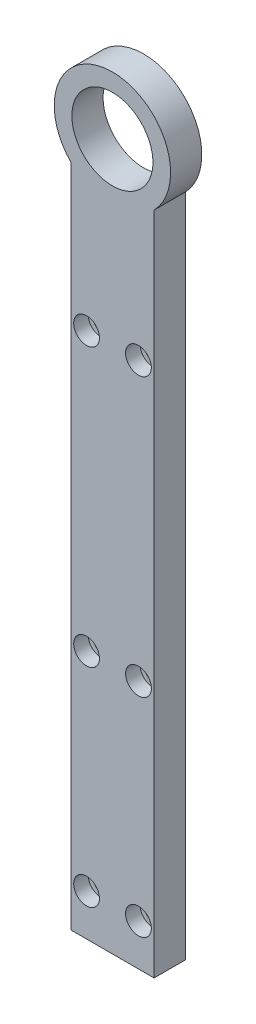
from build123d import *

# Parameters (mm, degrees)
SKETCH1_R           = 12.3825
SKETCH1_R_2         = 2.4765
BOSS_EXTRUDE1_DEPTH = 9.525
SKETCH2_R           = 3.937
CUT_EXTRUDE1_DEPTH  = 4.445


with BuildPart() as part:
    # Sketch1 → Boss-Extrude1 (new body)
    with BuildSketch(Plane.XY):
        with BuildLine():
            Line((-12.668384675, -12.475593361), (-12.668384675, -215.611058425))
            Line((-12.668384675, -215.611058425), (12.731615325, -215.611058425))
            Line((12.731615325, -215.611058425), (12.731615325, -12.411058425))
            ThreePointArc((12.731615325, -12.411058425), (-0.04517431, 17.779942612), (-12.668384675, -12.475593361))
        make_face()
        with Locations(Location((0, 0, 0), (0, 0, 180))):
            Circle(SKETCH1_R, mode=Mode.SUBTRACT)
        with Locations(Location((-7.893184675, -54.614193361, 0), (0, 0, 180))):
            Circle(SKETCH1_R_2, mode=Mode.SUBTRACT)
        with Locations(Location((-7.893184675, -202.911058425, 0), (0, 0, 180))):
            Circle(SKETCH1_R_2, mode=Mode.SUBTRACT)
        with Locations(Location((7.956415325, -202.911058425, 0), (0, 0, 180))):
            Circle(SKETCH1_R_2, mode=Mode.SUBTRACT)
        with Locations(Location((7.956415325, -54.549658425, 0), (0, 0, 180))):
            Circle(SKETCH1_R_2, mode=Mode.SUBTRACT)
        with Locations(Location((-7.893184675, -139.411058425, 0), (0, 0, 180))):
            Circle(SKETCH1_R_2, mode=Mode.SUBTRACT)
        with Locations(Location((7.969115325, -139.411058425, 0), (0, 0, 180))):
            Circle(SKETCH1_R_2, mode=Mode.SUBTRACT)
    extrude(amount=BOSS_EXTRUDE1_DEPTH)

    # Sketch2 → Cut-Extrude1 (cut)
    with BuildSketch(Plane.XY.offset(9.525)):
        with Locations((-7.893184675, -54.614193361)):
            Circle(SKETCH2_R)
        with Locations((7.956415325, -54.549658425)):
            Circle(SKETCH2_R)
        with Locations((-7.893184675, -139.411058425)):
            Circle(SKETCH2_R)
        with Locations((7.969115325, -139.411058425)):
            Circle(SKETCH2_R)
        with Locations((-7.893184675, -202.911058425)):
            Circle(SKETCH2_R)
        with Locations((7.956415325, -202.911058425)):
            Circle(SKETCH2_R)
    extrude(amount=-CUT_EXTRUDE1_DEPTH, mode=Mode.SUBTRACT)


solid = part.part
